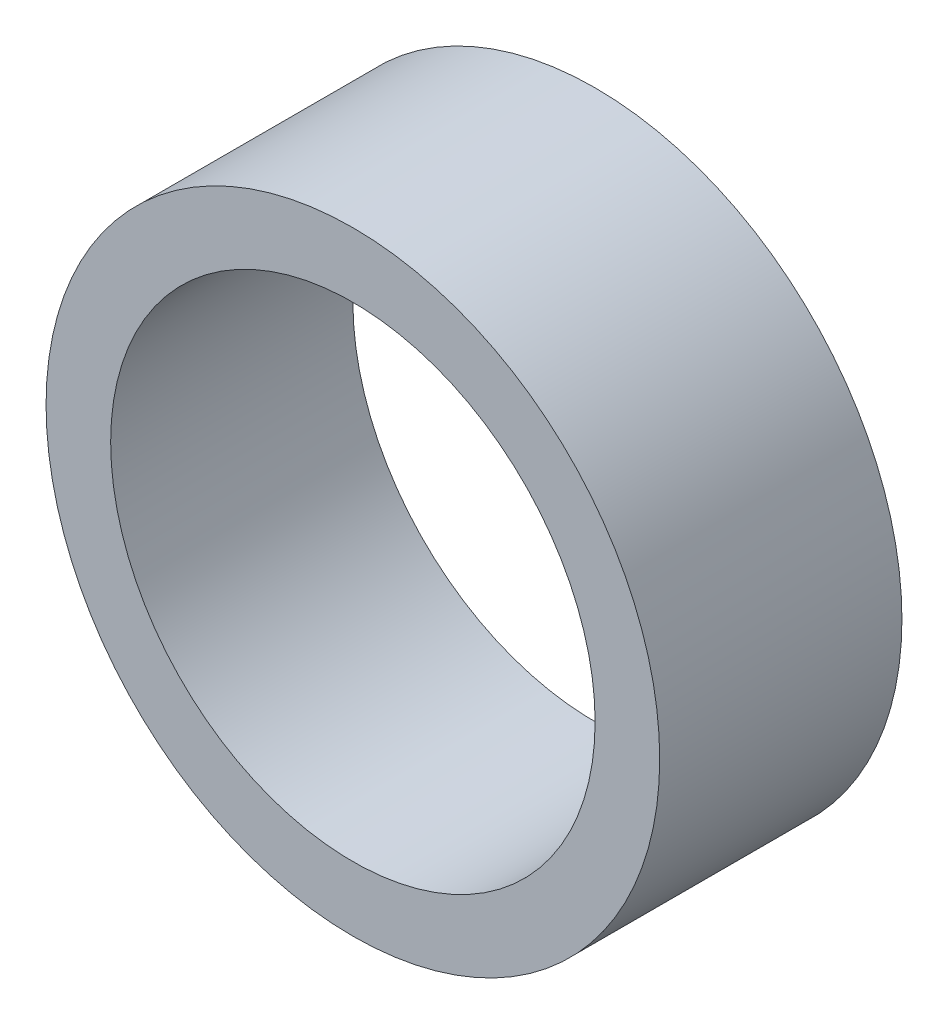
ISO-10303-21;
HEADER;
FILE_DESCRIPTION(('STEP AP214'),'2;1');
FILE_NAME('part.step','',(''),(''),'','','');
FILE_SCHEMA(('AUTOMOTIVE_DESIGN { 1 0 10303 214 1 1 1 1 }'));
ENDSEC;
DATA;
#1=APPLICATION_CONTEXT('core data for automotive mechanical design processes');
#2=APPLICATION_PROTOCOL_DEFINITION('international standard','automotive_design',2000,#1);
#3=PRODUCT_CONTEXT('',#1,'mechanical');
#4=PRODUCT('Part','Part','',(#3));
#5=PRODUCT_RELATED_PRODUCT_CATEGORY('part','',(#4));
#6=PRODUCT_DEFINITION_FORMATION('','',#4);
#7=PRODUCT_DEFINITION_CONTEXT('part definition',#1,'design');
#8=PRODUCT_DEFINITION('design','',#6,#7);
#9=PRODUCT_DEFINITION_SHAPE('','',#8);
#10=(LENGTH_UNIT() NAMED_UNIT(*) SI_UNIT(.MILLI.,.METRE.));
#11=(NAMED_UNIT(*) PLANE_ANGLE_UNIT() SI_UNIT($,.RADIAN.));
#12=(NAMED_UNIT(*) SI_UNIT($,.STERADIAN.) SOLID_ANGLE_UNIT());
#13=UNCERTAINTY_MEASURE_WITH_UNIT(LENGTH_MEASURE(1.E-05),#10,'distance_accuracy_value','');
#14=(GEOMETRIC_REPRESENTATION_CONTEXT(3) GLOBAL_UNCERTAINTY_ASSIGNED_CONTEXT((#13)) GLOBAL_UNIT_ASSIGNED_CONTEXT((#10,
#11,#12)) REPRESENTATION_CONTEXT('',''));
#15=CARTESIAN_POINT('',(0.,0.,0.));
#16=DIRECTION('',(0.,0.,1.));
#17=DIRECTION('',(1.,0.,0.));
#18=AXIS2_PLACEMENT_3D('',#15,#16,#17);
#19=CARTESIAN_POINT('',(0.,0.,7.5));
#20=DIRECTION('',(0.,0.,1.));
#21=DIRECTION('',(1.,0.,0.));
#22=AXIS2_PLACEMENT_3D('',#19,#20,#21);
#23=PLANE('',#22);
#24=CARTESIAN_POINT('',(0.,0.,7.5));
#25=DIRECTION('',(0.,0.,1.));
#26=DIRECTION('',(1.,0.,0.));
#27=AXIS2_PLACEMENT_3D('',#24,#25,#26);
#28=CIRCLE('',#27,19.);
#29=CARTESIAN_POINT('',(19.,0.,7.5));
#30=VERTEX_POINT('',#29);
#31=EDGE_CURVE('E10',#30,#30,#28,.T.);
#32=ORIENTED_EDGE('',*,*,#31,.T.);
#33=EDGE_LOOP('',(#32));
#34=FACE_BOUND('',#33,.T.);
#35=CARTESIAN_POINT('',(0.,0.,7.5));
#36=DIRECTION('',(0.,0.,1.));
#37=DIRECTION('',(1.,0.,0.));
#38=AXIS2_PLACEMENT_3D('',#35,#36,#37);
#39=CIRCLE('',#38,15.);
#40=CARTESIAN_POINT('',(15.,0.,7.5));
#41=VERTEX_POINT('',#40);
#42=EDGE_CURVE('E40',#41,#41,#39,.T.);
#43=ORIENTED_EDGE('',*,*,#42,.F.);
#44=EDGE_LOOP('',(#43));
#45=FACE_BOUND('',#44,.T.);
#46=ADVANCED_FACE('F29',(#34,#45),#23,.T.);
#47=CARTESIAN_POINT('',(0.,0.,-7.5));
#48=DIRECTION('',(0.,0.,1.));
#49=DIRECTION('',(1.,0.,0.));
#50=AXIS2_PLACEMENT_3D('',#47,#48,#49);
#51=PLANE('',#50);
#52=CARTESIAN_POINT('',(0.,0.,-7.5));
#53=DIRECTION('',(0.,0.,1.));
#54=DIRECTION('',(1.,0.,0.));
#55=AXIS2_PLACEMENT_3D('',#52,#53,#54);
#56=CIRCLE('',#55,19.);
#57=CARTESIAN_POINT('',(19.,0.,-7.5));
#58=VERTEX_POINT('',#57);
#59=EDGE_CURVE('E33',#58,#58,#56,.T.);
#60=ORIENTED_EDGE('',*,*,#59,.F.);
#61=EDGE_LOOP('',(#60));
#62=FACE_BOUND('',#61,.T.);
#63=CARTESIAN_POINT('',(0.,0.,-7.5));
#64=DIRECTION('',(0.,0.,1.));
#65=DIRECTION('',(1.,0.,0.));
#66=AXIS2_PLACEMENT_3D('',#63,#64,#65);
#67=CIRCLE('',#66,15.);
#68=CARTESIAN_POINT('',(15.,0.,-7.5));
#69=VERTEX_POINT('',#68);
#70=EDGE_CURVE('E42',#69,#69,#67,.T.);
#71=ORIENTED_EDGE('',*,*,#70,.T.);
#72=EDGE_LOOP('',(#71));
#73=FACE_BOUND('',#72,.T.);
#74=ADVANCED_FACE('F52',(#62,#73),#51,.F.);
#75=CARTESIAN_POINT('',(0.,0.,7.5));
#76=DIRECTION('',(0.,0.,-1.));
#77=DIRECTION('',(-1.,0.,0.));
#78=AXIS2_PLACEMENT_3D('',#75,#76,#77);
#79=CYLINDRICAL_SURFACE('',#78,19.);
#80=ORIENTED_EDGE('',*,*,#31,.F.);
#81=EDGE_LOOP('',(#80));
#82=FACE_BOUND('',#81,.T.);
#83=ORIENTED_EDGE('',*,*,#59,.T.);
#84=EDGE_LOOP('',(#83));
#85=FACE_BOUND('',#84,.T.);
#86=ADVANCED_FACE('F31',(#82,#85),#79,.T.);
#87=CARTESIAN_POINT('',(0.,0.,7.5));
#88=DIRECTION('',(0.,0.,-1.));
#89=DIRECTION('',(-1.,0.,0.));
#90=AXIS2_PLACEMENT_3D('',#87,#88,#89);
#91=CYLINDRICAL_SURFACE('',#90,15.);
#92=ORIENTED_EDGE('',*,*,#42,.T.);
#93=EDGE_LOOP('',(#92));
#94=FACE_BOUND('',#93,.T.);
#95=ORIENTED_EDGE('',*,*,#70,.F.);
#96=EDGE_LOOP('',(#95));
#97=FACE_BOUND('',#96,.T.);
#98=ADVANCED_FACE('F48',(#94,#97),#91,.F.);
#99=CLOSED_SHELL('',(#46,#74,#86,#98));
#100=MANIFOLD_SOLID_BREP('B2',#99);
#101=ADVANCED_BREP_SHAPE_REPRESENTATION('',(#18,#100),#14);
#102=SHAPE_DEFINITION_REPRESENTATION(#9,#101);
ENDSEC;
END-ISO-10303-21;
